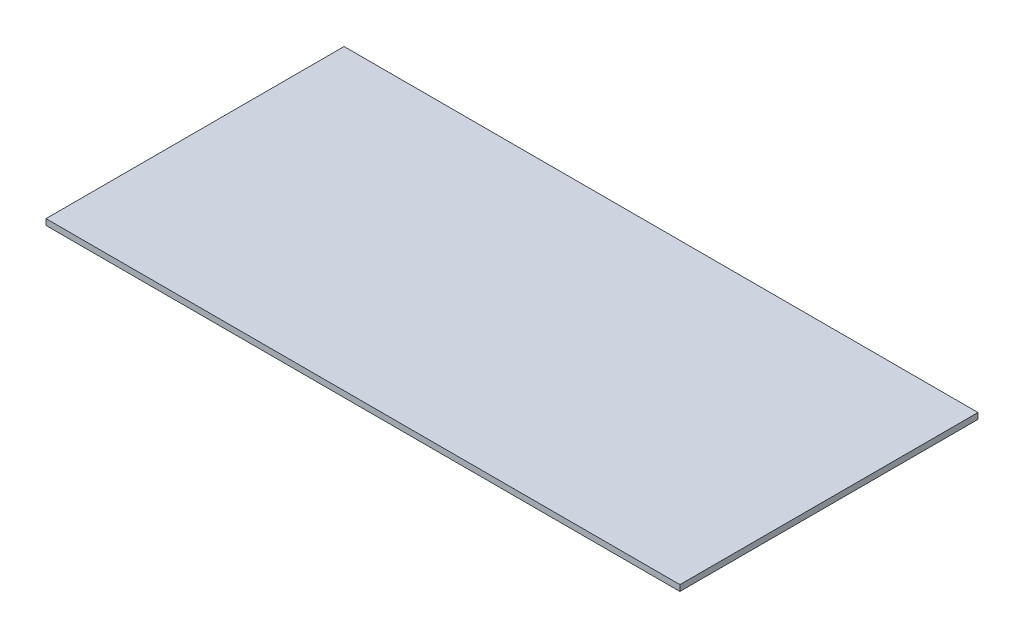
ISO-10303-21;
HEADER;
FILE_DESCRIPTION(('STEP AP214'),'2;1');
FILE_NAME('part.step','',(''),(''),'','','');
FILE_SCHEMA(('AUTOMOTIVE_DESIGN { 1 0 10303 214 1 1 1 1 }'));
ENDSEC;
DATA;
#1=APPLICATION_CONTEXT('core data for automotive mechanical design processes');
#2=APPLICATION_PROTOCOL_DEFINITION('international standard','automotive_design',2000,#1);
#3=PRODUCT_CONTEXT('',#1,'mechanical');
#4=PRODUCT('Part','Part','',(#3));
#5=PRODUCT_RELATED_PRODUCT_CATEGORY('part','',(#4));
#6=PRODUCT_DEFINITION_FORMATION('','',#4);
#7=PRODUCT_DEFINITION_CONTEXT('part definition',#1,'design');
#8=PRODUCT_DEFINITION('design','',#6,#7);
#9=PRODUCT_DEFINITION_SHAPE('','',#8);
#10=(LENGTH_UNIT() NAMED_UNIT(*) SI_UNIT(.MILLI.,.METRE.));
#11=(NAMED_UNIT(*) PLANE_ANGLE_UNIT() SI_UNIT($,.RADIAN.));
#12=(NAMED_UNIT(*) SI_UNIT($,.STERADIAN.) SOLID_ANGLE_UNIT());
#13=UNCERTAINTY_MEASURE_WITH_UNIT(LENGTH_MEASURE(1.E-05),#10,'distance_accuracy_value','');
#14=(GEOMETRIC_REPRESENTATION_CONTEXT(3) GLOBAL_UNCERTAINTY_ASSIGNED_CONTEXT((#13)) GLOBAL_UNIT_ASSIGNED_CONTEXT((#10,
#11,#12)) REPRESENTATION_CONTEXT('',''));
#15=CARTESIAN_POINT('',(0.,0.,0.));
#16=DIRECTION('',(0.,0.,1.));
#17=DIRECTION('',(1.,0.,0.));
#18=AXIS2_PLACEMENT_3D('',#15,#16,#17);
#19=CARTESIAN_POINT('',(319.,6.,150.));
#20=DIRECTION('',(-1.,0.,0.));
#21=DIRECTION('',(0.,0.,1.));
#22=AXIS2_PLACEMENT_3D('',#19,#20,#21);
#23=PLANE('',#22);
#24=DIRECTION('',(0.,0.,-1.));
#25=VECTOR('',#24,1.);
#26=CARTESIAN_POINT('',(319.,0.,150.));
#27=LINE('',#26,#25);
#28=CARTESIAN_POINT('',(319.,0.,150.));
#29=VERTEX_POINT('',#28);
#30=CARTESIAN_POINT('',(319.,0.,-150.));
#31=VERTEX_POINT('',#30);
#32=EDGE_CURVE('E96',#29,#31,#27,.T.);
#33=ORIENTED_EDGE('',*,*,#32,.T.);
#34=DIRECTION('',(0.,-1.,0.));
#35=VECTOR('',#34,1.);
#36=CARTESIAN_POINT('',(319.,6.,-150.));
#37=LINE('',#36,#35);
#38=CARTESIAN_POINT('',(319.,6.,-150.));
#39=VERTEX_POINT('',#38);
#40=EDGE_CURVE('E11',#39,#31,#37,.T.);
#41=ORIENTED_EDGE('',*,*,#40,.F.);
#42=DIRECTION('',(0.,0.,-1.));
#43=VECTOR('',#42,1.);
#44=CARTESIAN_POINT('',(319.,6.,150.));
#45=LINE('',#44,#43);
#46=CARTESIAN_POINT('',(319.,6.,150.));
#47=VERTEX_POINT('',#46);
#48=EDGE_CURVE('E84',#47,#39,#45,.T.);
#49=ORIENTED_EDGE('',*,*,#48,.F.);
#50=DIRECTION('',(0.,-1.,0.));
#51=VECTOR('',#50,1.);
#52=CARTESIAN_POINT('',(319.,6.,150.));
#53=LINE('',#52,#51);
#54=EDGE_CURVE('E92',#47,#29,#53,.T.);
#55=ORIENTED_EDGE('',*,*,#54,.T.);
#56=EDGE_LOOP('',(#33,#41,#49,#55));
#57=FACE_BOUND('',#56,.T.);
#58=ADVANCED_FACE('F33',(#57),#23,.F.);
#59=CARTESIAN_POINT('',(-319.,6.,-150.));
#60=DIRECTION('',(0.,0.,1.));
#61=DIRECTION('',(1.,0.,0.));
#62=AXIS2_PLACEMENT_3D('',#59,#60,#61);
#63=PLANE('',#62);
#64=DIRECTION('',(-1.,0.,0.));
#65=VECTOR('',#64,1.);
#66=CARTESIAN_POINT('',(-319.,0.,-150.));
#67=LINE('',#66,#65);
#68=CARTESIAN_POINT('',(-319.,0.,-150.));
#69=VERTEX_POINT('',#68);
#70=EDGE_CURVE('E88',#31,#69,#67,.T.);
#71=ORIENTED_EDGE('',*,*,#70,.T.);
#72=DIRECTION('',(0.,-1.,0.));
#73=VECTOR('',#72,1.);
#74=CARTESIAN_POINT('',(-319.,6.,-150.));
#75=LINE('',#74,#73);
#76=CARTESIAN_POINT('',(-319.,6.,-150.));
#77=VERTEX_POINT('',#76);
#78=EDGE_CURVE('E41',#77,#69,#75,.T.);
#79=ORIENTED_EDGE('',*,*,#78,.F.);
#80=DIRECTION('',(-1.,0.,0.));
#81=VECTOR('',#80,1.);
#82=CARTESIAN_POINT('',(-319.,6.,-150.));
#83=LINE('',#82,#81);
#84=EDGE_CURVE('E79',#39,#77,#83,.T.);
#85=ORIENTED_EDGE('',*,*,#84,.F.);
#86=ORIENTED_EDGE('',*,*,#40,.T.);
#87=EDGE_LOOP('',(#71,#79,#85,#86));
#88=FACE_BOUND('',#87,.T.);
#89=ADVANCED_FACE('F87',(#88),#63,.F.);
#90=CARTESIAN_POINT('',(-319.,6.,150.));
#91=DIRECTION('',(1.,0.,0.));
#92=DIRECTION('',(0.,0.,-1.));
#93=AXIS2_PLACEMENT_3D('',#90,#91,#92);
#94=PLANE('',#93);
#95=DIRECTION('',(0.,0.,1.));
#96=VECTOR('',#95,1.);
#97=CARTESIAN_POINT('',(-319.,0.,150.));
#98=LINE('',#97,#96);
#99=CARTESIAN_POINT('',(-319.,0.,150.));
#100=VERTEX_POINT('',#99);
#101=EDGE_CURVE('E66',#69,#100,#98,.T.);
#102=ORIENTED_EDGE('',*,*,#101,.T.);
#103=DIRECTION('',(0.,-1.,0.));
#104=VECTOR('',#103,1.);
#105=CARTESIAN_POINT('',(-319.,6.,150.));
#106=LINE('',#105,#104);
#107=CARTESIAN_POINT('',(-319.,6.,150.));
#108=VERTEX_POINT('',#107);
#109=EDGE_CURVE('E89',#108,#100,#106,.T.);
#110=ORIENTED_EDGE('',*,*,#109,.F.);
#111=DIRECTION('',(0.,0.,1.));
#112=VECTOR('',#111,1.);
#113=CARTESIAN_POINT('',(-319.,6.,150.));
#114=LINE('',#113,#112);
#115=EDGE_CURVE('E82',#77,#108,#114,.T.);
#116=ORIENTED_EDGE('',*,*,#115,.F.);
#117=ORIENTED_EDGE('',*,*,#78,.T.);
#118=EDGE_LOOP('',(#102,#110,#116,#117));
#119=FACE_BOUND('',#118,.T.);
#120=ADVANCED_FACE('F90',(#119),#94,.F.);
#121=CARTESIAN_POINT('',(-319.,6.,150.));
#122=DIRECTION('',(0.,0.,-1.));
#123=DIRECTION('',(-1.,0.,0.));
#124=AXIS2_PLACEMENT_3D('',#121,#122,#123);
#125=PLANE('',#124);
#126=DIRECTION('',(1.,0.,0.));
#127=VECTOR('',#126,1.);
#128=CARTESIAN_POINT('',(-319.,0.,150.));
#129=LINE('',#128,#127);
#130=EDGE_CURVE('E72',#100,#29,#129,.T.);
#131=ORIENTED_EDGE('',*,*,#130,.T.);
#132=ORIENTED_EDGE('',*,*,#54,.F.);
#133=DIRECTION('',(1.,0.,0.));
#134=VECTOR('',#133,1.);
#135=CARTESIAN_POINT('',(-319.,6.,150.));
#136=LINE('',#135,#134);
#137=EDGE_CURVE('E49',#108,#47,#136,.T.);
#138=ORIENTED_EDGE('',*,*,#137,.F.);
#139=ORIENTED_EDGE('',*,*,#109,.T.);
#140=EDGE_LOOP('',(#131,#132,#138,#139));
#141=FACE_BOUND('',#140,.T.);
#142=ADVANCED_FACE('F103',(#141),#125,.F.);
#143=CARTESIAN_POINT('',(0.,6.,0.));
#144=DIRECTION('',(0.,-1.,0.));
#145=DIRECTION('',(0.,0.,-1.));
#146=AXIS2_PLACEMENT_3D('',#143,#144,#145);
#147=PLANE('',#146);
#148=ORIENTED_EDGE('',*,*,#48,.T.);
#149=ORIENTED_EDGE('',*,*,#84,.T.);
#150=ORIENTED_EDGE('',*,*,#115,.T.);
#151=ORIENTED_EDGE('',*,*,#137,.T.);
#152=EDGE_LOOP('',(#148,#149,#150,#151));
#153=FACE_BOUND('',#152,.T.);
#154=ADVANCED_FACE('F80',(#153),#147,.F.);
#155=CARTESIAN_POINT('',(0.,0.,0.));
#156=DIRECTION('',(0.,-1.,0.));
#157=DIRECTION('',(0.,0.,-1.));
#158=AXIS2_PLACEMENT_3D('',#155,#156,#157);
#159=PLANE('',#158);
#160=ORIENTED_EDGE('',*,*,#32,.F.);
#161=ORIENTED_EDGE('',*,*,#130,.F.);
#162=ORIENTED_EDGE('',*,*,#101,.F.);
#163=ORIENTED_EDGE('',*,*,#70,.F.);
#164=EDGE_LOOP('',(#160,#161,#162,#163));
#165=FACE_BOUND('',#164,.T.);
#166=ADVANCED_FACE('F106',(#165),#159,.T.);
#167=CLOSED_SHELL('',(#58,#89,#120,#142,#154,#166));
#168=MANIFOLD_SOLID_BREP('B2',#167);
#169=ADVANCED_BREP_SHAPE_REPRESENTATION('',(#18,#168),#14);
#170=SHAPE_DEFINITION_REPRESENTATION(#9,#169);
ENDSEC;
END-ISO-10303-21;
